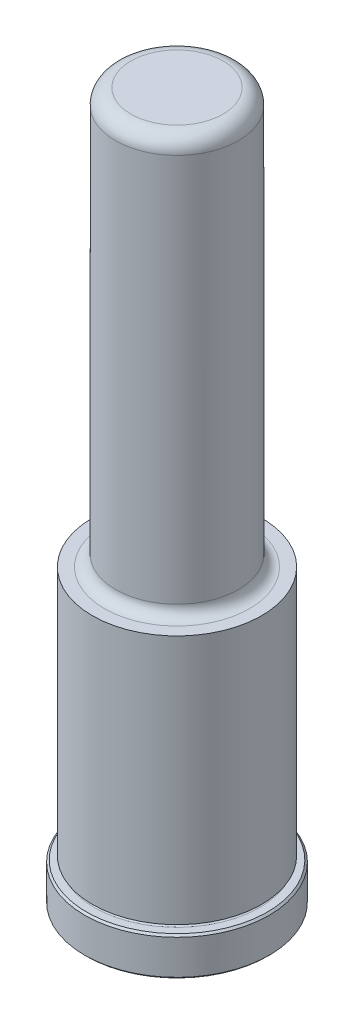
ISO-10303-21;
HEADER;
FILE_DESCRIPTION(('STEP AP214'),'2;1');
FILE_NAME('part.step','',(''),(''),'','','');
FILE_SCHEMA(('AUTOMOTIVE_DESIGN { 1 0 10303 214 1 1 1 1 }'));
ENDSEC;
DATA;
#1=APPLICATION_CONTEXT('core data for automotive mechanical design processes');
#2=APPLICATION_PROTOCOL_DEFINITION('international standard','automotive_design',2000,#1);
#3=PRODUCT_CONTEXT('',#1,'mechanical');
#4=PRODUCT('Part','Part','',(#3));
#5=PRODUCT_RELATED_PRODUCT_CATEGORY('part','',(#4));
#6=PRODUCT_DEFINITION_FORMATION('','',#4);
#7=PRODUCT_DEFINITION_CONTEXT('part definition',#1,'design');
#8=PRODUCT_DEFINITION('design','',#6,#7);
#9=PRODUCT_DEFINITION_SHAPE('','',#8);
#10=(LENGTH_UNIT() NAMED_UNIT(*) SI_UNIT(.MILLI.,.METRE.));
#11=(NAMED_UNIT(*) PLANE_ANGLE_UNIT() SI_UNIT($,.RADIAN.));
#12=(NAMED_UNIT(*) SI_UNIT($,.STERADIAN.) SOLID_ANGLE_UNIT());
#13=UNCERTAINTY_MEASURE_WITH_UNIT(LENGTH_MEASURE(1.E-05),#10,'distance_accuracy_value','');
#14=(GEOMETRIC_REPRESENTATION_CONTEXT(3) GLOBAL_UNCERTAINTY_ASSIGNED_CONTEXT((#13)) GLOBAL_UNIT_ASSIGNED_CONTEXT((#10,
#11,#12)) REPRESENTATION_CONTEXT('',''));
#15=CARTESIAN_POINT('',(0.,0.,0.));
#16=DIRECTION('',(0.,0.,1.));
#17=DIRECTION('',(1.,0.,0.));
#18=AXIS2_PLACEMENT_3D('',#15,#16,#17);
#19=CARTESIAN_POINT('',(0.,0.,0.));
#20=DIRECTION('',(0.,1.,0.));
#21=DIRECTION('',(0.,0.,1.));
#22=AXIS2_PLACEMENT_3D('',#19,#20,#21);
#23=PLANE('',#22);
#24=CARTESIAN_POINT('',(0.,0.,0.));
#25=DIRECTION('',(0.,1.,0.));
#26=DIRECTION('',(0.,0.,1.));
#27=AXIS2_PLACEMENT_3D('',#24,#25,#26);
#28=CIRCLE('',#27,18.669);
#29=CARTESIAN_POINT('',(0.,0.,18.669));
#30=VERTEX_POINT('',#29);
#31=EDGE_CURVE('E46',#30,#30,#28,.F.);
#32=ORIENTED_EDGE('',*,*,#31,.T.);
#33=EDGE_LOOP('',(#32));
#34=FACE_BOUND('',#33,.T.);
#35=ADVANCED_FACE('F31',(#34),#23,.F.);
#36=CARTESIAN_POINT('',(0.,0.,0.));
#37=DIRECTION('',(0.,1.,0.));
#38=DIRECTION('',(0.,0.,1.));
#39=AXIS2_PLACEMENT_3D('',#36,#37,#38);
#40=CYLINDRICAL_SURFACE('',#39,19.05);
#41=CARTESIAN_POINT('',(0.,0.381000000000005,0.));
#42=DIRECTION('',(0.,1.,0.));
#43=DIRECTION('',(0.,0.,1.));
#44=AXIS2_PLACEMENT_3D('',#41,#42,#43);
#45=CIRCLE('',#44,19.05);
#46=CARTESIAN_POINT('',(0.,0.381000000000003,19.05));
#47=VERTEX_POINT('',#46);
#48=EDGE_CURVE('E51',#47,#47,#45,.T.);
#49=ORIENTED_EDGE('',*,*,#48,.T.);
#50=EDGE_LOOP('',(#49));
#51=FACE_BOUND('',#50,.T.);
#52=CARTESIAN_POINT('',(0.,7.54380000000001,0.));
#53=DIRECTION('',(0.,-1.,0.));
#54=DIRECTION('',(0.,0.,-1.));
#55=AXIS2_PLACEMENT_3D('',#52,#53,#54);
#56=CIRCLE('',#55,19.05);
#57=CARTESIAN_POINT('',(0.,7.54380000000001,-19.05));
#58=VERTEX_POINT('',#57);
#59=EDGE_CURVE('E54',#58,#58,#56,.T.);
#60=ORIENTED_EDGE('',*,*,#59,.T.);
#61=EDGE_LOOP('',(#60));
#62=FACE_BOUND('',#61,.T.);
#63=ADVANCED_FACE('F110',(#51,#62),#40,.T.);
#64=CARTESIAN_POINT('',(0.,7.9248,-19.05));
#65=DIRECTION('',(0.,-1.,0.));
#66=DIRECTION('',(0.,0.,-1.));
#67=AXIS2_PLACEMENT_3D('',#64,#65,#66);
#68=PLANE('',#67);
#69=CARTESIAN_POINT('',(0.,7.9248,0.));
#70=DIRECTION('',(0.,-1.,0.));
#71=DIRECTION('',(0.,0.,-1.));
#72=AXIS2_PLACEMENT_3D('',#69,#70,#71);
#73=CIRCLE('',#72,18.669);
#74=CARTESIAN_POINT('',(0.,7.9248,-18.669));
#75=VERTEX_POINT('',#74);
#76=EDGE_CURVE('E42',#75,#75,#73,.F.);
#77=ORIENTED_EDGE('',*,*,#76,.T.);
#78=EDGE_LOOP('',(#77));
#79=FACE_BOUND('',#78,.T.);
#80=CARTESIAN_POINT('',(0.,7.9248,0.));
#81=DIRECTION('',(0.,1.,0.));
#82=DIRECTION('',(0.,0.,1.));
#83=AXIS2_PLACEMENT_3D('',#80,#81,#82);
#84=CIRCLE('',#83,17.0688);
#85=CARTESIAN_POINT('',(0.,7.92479999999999,17.0688));
#86=VERTEX_POINT('',#85);
#87=EDGE_CURVE('E57',#86,#86,#84,.T.);
#88=ORIENTED_EDGE('',*,*,#87,.F.);
#89=EDGE_LOOP('',(#88));
#90=FACE_BOUND('',#89,.T.);
#91=ADVANCED_FACE('F105',(#79,#90),#68,.F.);
#92=CARTESIAN_POINT('',(0.,8.3058,0.));
#93=DIRECTION('',(0.,1.,0.));
#94=DIRECTION('',(0.,0.,1.));
#95=AXIS2_PLACEMENT_3D('',#92,#93,#94);
#96=TOROIDAL_SURFACE('',#95,17.0688,0.381000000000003);
#97=CARTESIAN_POINT('',(0.,8.6868,0.));
#98=DIRECTION('',(0.,1.,0.));
#99=DIRECTION('',(0.,0.,1.));
#100=AXIS2_PLACEMENT_3D('',#97,#98,#99);
#101=CIRCLE('',#100,17.0688);
#102=CARTESIAN_POINT('',(0.,8.6868,17.0688));
#103=VERTEX_POINT('',#102);
#104=EDGE_CURVE('E60',#103,#103,#101,.T.);
#105=ORIENTED_EDGE('',*,*,#104,.F.);
#106=EDGE_LOOP('',(#105));
#107=FACE_BOUND('',#106,.T.);
#108=ORIENTED_EDGE('',*,*,#87,.T.);
#109=EDGE_LOOP('',(#108));
#110=FACE_BOUND('',#109,.T.);
#111=ADVANCED_FACE('F99',(#107,#110),#96,.F.);
#112=CARTESIAN_POINT('',(0.,8.6868,-17.0688));
#113=DIRECTION('',(0.,1.,0.));
#114=DIRECTION('',(0.,0.,1.));
#115=AXIS2_PLACEMENT_3D('',#112,#113,#114);
#116=PLANE('',#115);
#117=CARTESIAN_POINT('',(0.,8.6868,0.));
#118=DIRECTION('',(0.,1.,0.));
#119=DIRECTION('',(0.,0.,1.));
#120=AXIS2_PLACEMENT_3D('',#117,#118,#119);
#121=CIRCLE('',#120,17.4752);
#122=CARTESIAN_POINT('',(0.,8.6868,17.4752));
#123=VERTEX_POINT('',#122);
#124=EDGE_CURVE('E63',#123,#123,#121,.T.);
#125=ORIENTED_EDGE('',*,*,#124,.F.);
#126=EDGE_LOOP('',(#125));
#127=FACE_BOUND('',#126,.T.);
#128=ORIENTED_EDGE('',*,*,#104,.T.);
#129=EDGE_LOOP('',(#128));
#130=FACE_BOUND('',#129,.T.);
#131=ADVANCED_FACE('F93',(#127,#130),#116,.F.);
#132=CARTESIAN_POINT('',(0.,0.,0.));
#133=DIRECTION('',(0.,1.,0.));
#134=DIRECTION('',(0.,0.,1.));
#135=AXIS2_PLACEMENT_3D('',#132,#133,#134);
#136=CYLINDRICAL_SURFACE('',#135,17.4752);
#137=CARTESIAN_POINT('',(0.,60.325,0.));
#138=DIRECTION('',(0.,1.,0.));
#139=DIRECTION('',(0.,0.,1.));
#140=AXIS2_PLACEMENT_3D('',#137,#138,#139);
#141=CIRCLE('',#140,17.4752);
#142=CARTESIAN_POINT('',(0.,60.325,17.4752));
#143=VERTEX_POINT('',#142);
#144=EDGE_CURVE('E66',#143,#143,#141,.T.);
#145=ORIENTED_EDGE('',*,*,#144,.F.);
#146=EDGE_LOOP('',(#145));
#147=FACE_BOUND('',#146,.T.);
#148=ORIENTED_EDGE('',*,*,#124,.T.);
#149=EDGE_LOOP('',(#148));
#150=FACE_BOUND('',#149,.T.);
#151=ADVANCED_FACE('F87',(#147,#150),#136,.T.);
#152=CARTESIAN_POINT('',(0.,60.325,-17.4752));
#153=DIRECTION('',(0.,-1.,0.));
#154=DIRECTION('',(0.,0.,-1.));
#155=AXIS2_PLACEMENT_3D('',#152,#153,#154);
#156=PLANE('',#155);
#157=CARTESIAN_POINT('',(0.,60.325,0.));
#158=DIRECTION('',(0.,1.,0.));
#159=DIRECTION('',(0.,0.,1.));
#160=AXIS2_PLACEMENT_3D('',#157,#158,#159);
#161=CIRCLE('',#160,14.9733);
#162=CARTESIAN_POINT('',(0.,60.325,14.9733));
#163=VERTEX_POINT('',#162);
#164=EDGE_CURVE('E69',#163,#163,#161,.T.);
#165=ORIENTED_EDGE('',*,*,#164,.F.);
#166=EDGE_LOOP('',(#165));
#167=FACE_BOUND('',#166,.T.);
#168=ORIENTED_EDGE('',*,*,#144,.T.);
#169=EDGE_LOOP('',(#168));
#170=FACE_BOUND('',#169,.T.);
#171=ADVANCED_FACE('F81',(#167,#170),#156,.F.);
#172=CARTESIAN_POINT('',(0.,62.611,0.));
#173=DIRECTION('',(0.,1.,0.));
#174=DIRECTION('',(0.,0.,1.));
#175=AXIS2_PLACEMENT_3D('',#172,#173,#174);
#176=TOROIDAL_SURFACE('',#175,14.9733,2.286);
#177=CARTESIAN_POINT('',(0.,62.611,0.));
#178=DIRECTION('',(0.,1.,0.));
#179=DIRECTION('',(0.,0.,1.));
#180=AXIS2_PLACEMENT_3D('',#177,#178,#179);
#181=CIRCLE('',#180,12.6873);
#182=CARTESIAN_POINT('',(0.,62.611,12.6873));
#183=VERTEX_POINT('',#182);
#184=EDGE_CURVE('E72',#183,#183,#181,.T.);
#185=ORIENTED_EDGE('',*,*,#184,.F.);
#186=EDGE_LOOP('',(#185));
#187=FACE_BOUND('',#186,.T.);
#188=ORIENTED_EDGE('',*,*,#164,.T.);
#189=EDGE_LOOP('',(#188));
#190=FACE_BOUND('',#189,.T.);
#191=ADVANCED_FACE('F78',(#187,#190),#176,.F.);
#192=CARTESIAN_POINT('',(0.,0.,0.));
#193=DIRECTION('',(0.,1.,0.));
#194=DIRECTION('',(0.,0.,1.));
#195=AXIS2_PLACEMENT_3D('',#192,#193,#194);
#196=CYLINDRICAL_SURFACE('',#195,12.6873);
#197=CARTESIAN_POINT('',(0.,142.875,0.));
#198=DIRECTION('',(0.,-1.,0.));
#199=DIRECTION('',(0.,0.,-1.));
#200=AXIS2_PLACEMENT_3D('',#197,#198,#199);
#201=CIRCLE('',#200,12.6873);
#202=CARTESIAN_POINT('',(0.,142.875,-12.6873));
#203=VERTEX_POINT('',#202);
#204=EDGE_CURVE('E10',#203,#203,#201,.T.);
#205=ORIENTED_EDGE('',*,*,#204,.T.);
#206=EDGE_LOOP('',(#205));
#207=FACE_BOUND('',#206,.T.);
#208=ORIENTED_EDGE('',*,*,#184,.T.);
#209=EDGE_LOOP('',(#208));
#210=FACE_BOUND('',#209,.T.);
#211=ADVANCED_FACE('F76',(#207,#210),#196,.T.);
#212=CARTESIAN_POINT('',(0.,146.05,-12.6873));
#213=DIRECTION('',(0.,-1.,0.));
#214=DIRECTION('',(0.,0.,-1.));
#215=AXIS2_PLACEMENT_3D('',#212,#213,#214);
#216=PLANE('',#215);
#217=CARTESIAN_POINT('',(0.,146.05,0.));
#218=DIRECTION('',(0.,-1.,0.));
#219=DIRECTION('',(0.,0.,-1.));
#220=AXIS2_PLACEMENT_3D('',#217,#218,#219);
#221=CIRCLE('',#220,9.51230000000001);
#222=CARTESIAN_POINT('',(0.,146.05,-9.51229999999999));
#223=VERTEX_POINT('',#222);
#224=EDGE_CURVE('E38',#223,#223,#221,.F.);
#225=ORIENTED_EDGE('',*,*,#224,.T.);
#226=EDGE_LOOP('',(#225));
#227=FACE_BOUND('',#226,.T.);
#228=ADVANCED_FACE('F127',(#227),#216,.F.);
#229=CARTESIAN_POINT('',(0.,0.381000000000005,0.));
#230=DIRECTION('',(0.,1.,0.));
#231=DIRECTION('',(0.,0.,1.));
#232=AXIS2_PLACEMENT_3D('',#229,#230,#231);
#233=CONICAL_SURFACE('',#232,19.05,0.785398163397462);
#234=ORIENTED_EDGE('',*,*,#31,.F.);
#235=EDGE_LOOP('',(#234));
#236=FACE_BOUND('',#235,.T.);
#237=ORIENTED_EDGE('',*,*,#48,.F.);
#238=EDGE_LOOP('',(#237));
#239=FACE_BOUND('',#238,.T.);
#240=ADVANCED_FACE('F124',(#236,#239),#233,.T.);
#241=CARTESIAN_POINT('',(0.,7.9248,0.));
#242=DIRECTION('',(0.,-1.,0.));
#243=DIRECTION('',(0.,0.,-1.));
#244=AXIS2_PLACEMENT_3D('',#241,#242,#243);
#245=CONICAL_SURFACE('',#244,18.669,0.785398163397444);
#246=ORIENTED_EDGE('',*,*,#59,.F.);
#247=EDGE_LOOP('',(#246));
#248=FACE_BOUND('',#247,.T.);
#249=ORIENTED_EDGE('',*,*,#76,.F.);
#250=EDGE_LOOP('',(#249));
#251=FACE_BOUND('',#250,.T.);
#252=ADVANCED_FACE('F126',(#248,#251),#245,.T.);
#253=CARTESIAN_POINT('',(0.,142.875,0.));
#254=DIRECTION('',(0.,-1.,0.));
#255=DIRECTION('',(0.,0.,-1.));
#256=AXIS2_PLACEMENT_3D('',#253,#254,#255);
#257=TOROIDAL_SURFACE('',#256,9.51230000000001,3.175);
#258=ORIENTED_EDGE('',*,*,#204,.F.);
#259=EDGE_LOOP('',(#258));
#260=FACE_BOUND('',#259,.T.);
#261=ORIENTED_EDGE('',*,*,#224,.F.);
#262=EDGE_LOOP('',(#261));
#263=FACE_BOUND('',#262,.T.);
#264=ADVANCED_FACE('F33',(#260,#263),#257,.T.);
#265=CLOSED_SHELL('',(#35,#63,#91,#111,#131,#151,#171,#191,#211,#228,#240,#252,#264));
#266=MANIFOLD_SOLID_BREP('B2',#265);
#267=ADVANCED_BREP_SHAPE_REPRESENTATION('',(#18,#266),#14);
#268=SHAPE_DEFINITION_REPRESENTATION(#9,#267);
ENDSEC;
END-ISO-10303-21;
